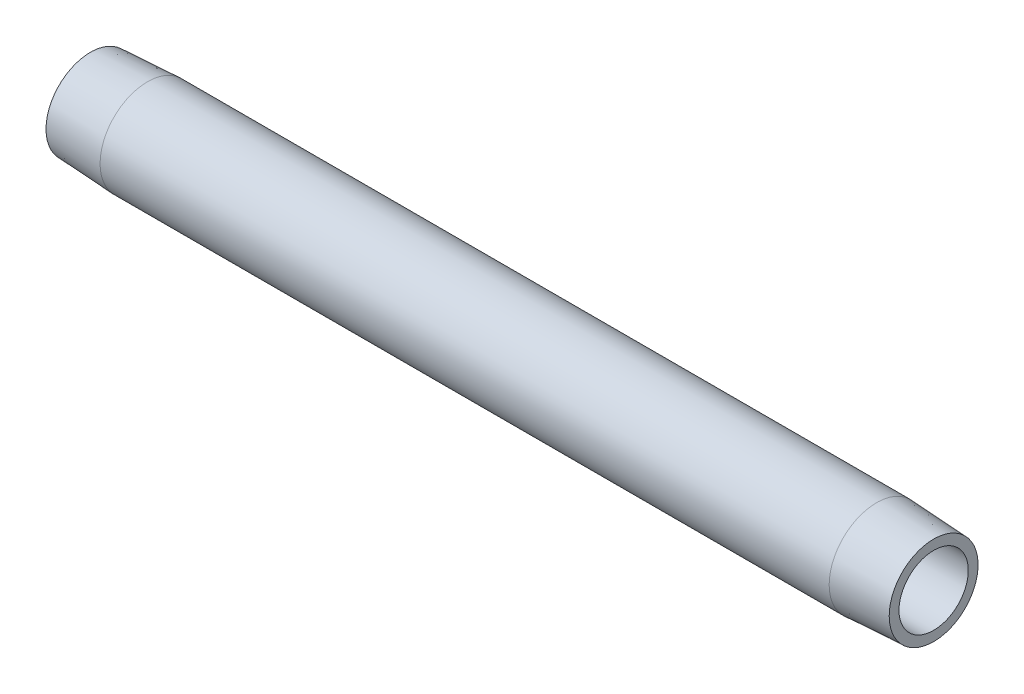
from build123d import *


with BuildPart() as part:
    # Sketch1 → Revolve1 (revolve)
    with BuildSketch(Plane.XY, mode=Mode.PRIVATE) as revolve1_sk:
        Polygon((152.4, 6.2611), (0, 6.2611), (0, 8.032050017), (10.3124, 8.5725), (142.0876, 8.5725), (152.4, 8.032050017), align=None)
    revolve(revolve1_sk.sketch.rotate(Axis((0, 0, 0), (1, 0, 0)), 90), axis=Axis((0, 0, 0), (1, 0, 0)))


solid = part.part
